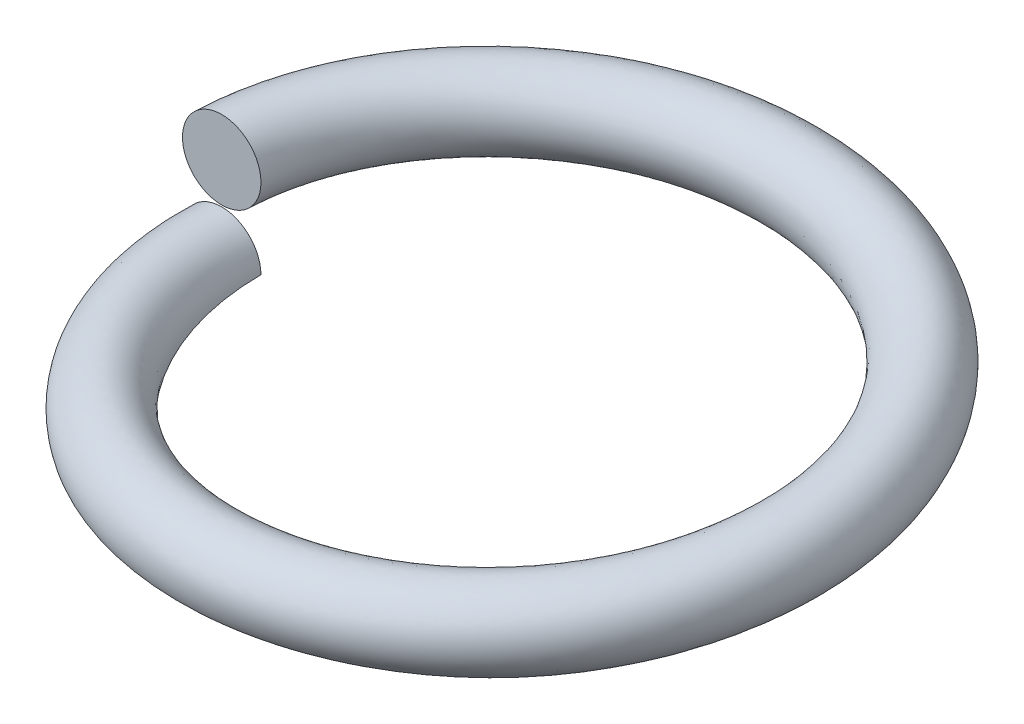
ISO-10303-21;
HEADER;
FILE_DESCRIPTION(('STEP AP214'),'2;1');
FILE_NAME('part.step','',(''),(''),'','','');
FILE_SCHEMA(('AUTOMOTIVE_DESIGN { 1 0 10303 214 1 1 1 1 }'));
ENDSEC;
DATA;
#1=APPLICATION_CONTEXT('core data for automotive mechanical design processes');
#2=APPLICATION_PROTOCOL_DEFINITION('international standard','automotive_design',2000,#1);
#3=PRODUCT_CONTEXT('',#1,'mechanical');
#4=PRODUCT('Part','Part','',(#3));
#5=PRODUCT_RELATED_PRODUCT_CATEGORY('part','',(#4));
#6=PRODUCT_DEFINITION_FORMATION('','',#4);
#7=PRODUCT_DEFINITION_CONTEXT('part definition',#1,'design');
#8=PRODUCT_DEFINITION('design','',#6,#7);
#9=PRODUCT_DEFINITION_SHAPE('','',#8);
#10=(LENGTH_UNIT() NAMED_UNIT(*) SI_UNIT(.MILLI.,.METRE.));
#11=(NAMED_UNIT(*) PLANE_ANGLE_UNIT() SI_UNIT($,.RADIAN.));
#12=(NAMED_UNIT(*) SI_UNIT($,.STERADIAN.) SOLID_ANGLE_UNIT());
#13=UNCERTAINTY_MEASURE_WITH_UNIT(LENGTH_MEASURE(1.E-05),#10,'distance_accuracy_value','');
#14=(GEOMETRIC_REPRESENTATION_CONTEXT(3) GLOBAL_UNCERTAINTY_ASSIGNED_CONTEXT((#13)) GLOBAL_UNIT_ASSIGNED_CONTEXT((#10,
#11,#12)) REPRESENTATION_CONTEXT('',''));
#15=CARTESIAN_POINT('',(0.,0.,0.));
#16=DIRECTION('',(0.,0.,1.));
#17=DIRECTION('',(1.,0.,0.));
#18=AXIS2_PLACEMENT_3D('',#15,#16,#17);
#19=CARTESIAN_POINT('',(-18.5,0.,0.));
#20=DIRECTION('',(0.,0.,1.));
#21=DIRECTION('',(1.,0.,0.));
#22=AXIS2_PLACEMENT_3D('',#19,#20,#21);
#23=PLANE('',#22);
#24=CARTESIAN_POINT('',(-18.5,0.,0.));
#25=DIRECTION('',(0.,0.,1.));
#26=DIRECTION('',(1.,0.,0.));
#27=AXIS2_PLACEMENT_3D('',#24,#25,#26);
#28=CIRCLE('',#27,2.5);
#29=CARTESIAN_POINT('',(-16.,0.,0.));
#30=VERTEX_POINT('',#29);
#31=CARTESIAN_POINT('',(-21.,0.,0.));
#32=VERTEX_POINT('',#31);
#33=EDGE_CURVE('E56',#30,#32,#28,.T.);
#34=ORIENTED_EDGE('',*,*,#33,.F.);
#35=DIRECTION('',(-1.,0.,0.));
#36=VECTOR('',#35,1.);
#37=CARTESIAN_POINT('',(-18.5,0.,0.));
#38=LINE('',#37,#36);
#39=EDGE_CURVE('E62',#30,#32,#38,.T.);
#40=ORIENTED_EDGE('',*,*,#39,.T.);
#41=EDGE_LOOP('',(#34,#40));
#42=FACE_BOUND('',#41,.T.);
#43=ADVANCED_FACE('F37',(#42),#23,.F.);
#44=CARTESIAN_POINT('',(-18.5,5.1,2.58369619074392E-13));
#45=DIRECTION('',(0.,0.,1.));
#46=DIRECTION('',(1.,0.,0.));
#47=AXIS2_PLACEMENT_3D('',#44,#45,#46);
#48=PLANE('',#47);
#49=CARTESIAN_POINT('',(-18.5,5.1,2.58369619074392E-13));
#50=DIRECTION('',(0.,0.,1.));
#51=DIRECTION('',(1.,0.,0.));
#52=AXIS2_PLACEMENT_3D('',#49,#50,#51);
#53=CIRCLE('',#52,2.5);
#54=CARTESIAN_POINT('',(-16.,5.1,2.2345480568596E-13));
#55=VERTEX_POINT('',#54);
#56=EDGE_CURVE('E50',#55,#55,#53,.T.);
#57=ORIENTED_EDGE('',*,*,#56,.T.);
#58=EDGE_LOOP('',(#57));
#59=FACE_BOUND('',#58,.T.);
#60=ADVANCED_FACE('F71',(#59),#48,.T.);
#61=CARTESIAN_POINT('',(-16.,0.,0.));
#62=CARTESIAN_POINT('',(-16.,0.424999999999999,9.23760430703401));
#63=CARTESIAN_POINT('',(-8.,0.849999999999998,13.856406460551));
#64=CARTESIAN_POINT('',(0.,1.275,18.475208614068));
#65=CARTESIAN_POINT('',(7.99999999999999,1.7,13.856406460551));
#66=CARTESIAN_POINT('',(16.,2.125,9.23760430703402));
#67=CARTESIAN_POINT('',(16.,2.54999999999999,0.));
#68=CARTESIAN_POINT('',(16.,2.97499999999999,-9.237604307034));
#69=CARTESIAN_POINT('',(8.00000000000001,3.39999999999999,-13.856406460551));
#70=CARTESIAN_POINT('',(0.,3.82499999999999,-18.475208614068));
#71=CARTESIAN_POINT('',(-7.99999999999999,4.24999999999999,-13.856406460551));
#72=CARTESIAN_POINT('',(-16.,4.67499999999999,-9.23760430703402));
#73=CARTESIAN_POINT('',(-16.,5.09999999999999,0.));
#74=CARTESIAN_POINT('',(-16.,5.,0.));
#75=CARTESIAN_POINT('',(-16.,5.425,9.23760430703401));
#76=CARTESIAN_POINT('',(-8.,5.85,13.856406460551));
#77=CARTESIAN_POINT('',(0.,6.275,18.475208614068));
#78=CARTESIAN_POINT('',(7.99999999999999,6.7,13.856406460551));
#79=CARTESIAN_POINT('',(16.,7.125,9.23760430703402));
#80=CARTESIAN_POINT('',(16.,7.55,0.));
#81=CARTESIAN_POINT('',(16.,7.975,-9.237604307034));
#82=CARTESIAN_POINT('',(8.00000000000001,8.4,-13.856406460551));
#83=CARTESIAN_POINT('',(0.,8.82499999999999,-18.475208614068));
#84=CARTESIAN_POINT('',(-7.99999999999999,9.24999999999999,-13.856406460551));
#85=CARTESIAN_POINT('',(-16.,9.67499999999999,-9.23760430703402));
#86=CARTESIAN_POINT('',(-16.,10.1,0.));
#87=CARTESIAN_POINT('',(-21.,5.,0.));
#88=CARTESIAN_POINT('',(-21.,5.425,12.1243556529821));
#89=CARTESIAN_POINT('',(-10.5,5.85,18.1865334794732));
#90=CARTESIAN_POINT('',(0.,6.275,24.2487113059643));
#91=CARTESIAN_POINT('',(10.5,6.7,18.1865334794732));
#92=CARTESIAN_POINT('',(21.,7.125,12.1243556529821));
#93=CARTESIAN_POINT('',(21.,7.55,0.));
#94=CARTESIAN_POINT('',(21.,7.975,-12.1243556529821));
#95=CARTESIAN_POINT('',(10.5,8.4,-18.1865334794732));
#96=CARTESIAN_POINT('',(0.,8.82499999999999,-24.2487113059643));
#97=CARTESIAN_POINT('',(-10.5,9.24999999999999,-18.1865334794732));
#98=CARTESIAN_POINT('',(-21.,9.67499999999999,-12.1243556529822));
#99=CARTESIAN_POINT('',(-21.,10.1,0.));
#100=CARTESIAN_POINT('',(-21.,0.,0.));
#101=CARTESIAN_POINT('',(-21.,0.424999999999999,12.1243556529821));
#102=CARTESIAN_POINT('',(-10.5,0.849999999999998,18.1865334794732));
#103=CARTESIAN_POINT('',(0.,1.275,24.2487113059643));
#104=CARTESIAN_POINT('',(10.5,1.7,18.1865334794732));
#105=CARTESIAN_POINT('',(21.,2.125,12.1243556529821));
#106=CARTESIAN_POINT('',(21.,2.54999999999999,0.));
#107=CARTESIAN_POINT('',(21.,2.97499999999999,-12.1243556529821));
#108=CARTESIAN_POINT('',(10.5,3.39999999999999,-18.1865334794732));
#109=CARTESIAN_POINT('',(0.,3.82499999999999,-24.2487113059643));
#110=CARTESIAN_POINT('',(-10.5,4.24999999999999,-18.1865334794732));
#111=CARTESIAN_POINT('',(-21.,4.67499999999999,-12.1243556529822));
#112=CARTESIAN_POINT('',(-21.,5.09999999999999,0.));
#113=CARTESIAN_POINT('',(-21.,-5.,0.));
#114=CARTESIAN_POINT('',(-21.,-4.575,12.1243556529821));
#115=CARTESIAN_POINT('',(-10.5,-4.15000000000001,18.1865334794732));
#116=CARTESIAN_POINT('',(0.,-3.72500000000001,24.2487113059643));
#117=CARTESIAN_POINT('',(10.5,-3.30000000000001,18.1865334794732));
#118=CARTESIAN_POINT('',(21.,-2.87500000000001,12.1243556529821));
#119=CARTESIAN_POINT('',(21.,-2.45000000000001,0.));
#120=CARTESIAN_POINT('',(21.,-2.02500000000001,-12.1243556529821));
#121=CARTESIAN_POINT('',(10.5,-1.60000000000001,-18.1865334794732));
#122=CARTESIAN_POINT('',(0.,-1.17500000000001,-24.2487113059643));
#123=CARTESIAN_POINT('',(-10.5,-0.750000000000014,-18.1865334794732));
#124=CARTESIAN_POINT('',(-21.,-0.325000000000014,-12.1243556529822));
#125=CARTESIAN_POINT('',(-21.,0.0999999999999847,0.));
#126=CARTESIAN_POINT('',(-16.,-5.,0.));
#127=CARTESIAN_POINT('',(-16.,-4.575,9.23760430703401));
#128=CARTESIAN_POINT('',(-8.,-4.15000000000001,13.856406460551));
#129=CARTESIAN_POINT('',(0.,-3.72500000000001,18.475208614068));
#130=CARTESIAN_POINT('',(7.99999999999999,-3.30000000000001,13.856406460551));
#131=CARTESIAN_POINT('',(16.,-2.87500000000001,9.23760430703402));
#132=CARTESIAN_POINT('',(16.,-2.45000000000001,0.));
#133=CARTESIAN_POINT('',(16.,-2.02500000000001,-9.237604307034));
#134=CARTESIAN_POINT('',(8.00000000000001,-1.60000000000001,-13.856406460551));
#135=CARTESIAN_POINT('',(0.,-1.17500000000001,-18.475208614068));
#136=CARTESIAN_POINT('',(-7.99999999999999,-0.750000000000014,-13.856406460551));
#137=CARTESIAN_POINT('',(-16.,-0.325000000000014,-9.23760430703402));
#138=CARTESIAN_POINT('',(-16.,0.0999999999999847,0.));
#139=CARTESIAN_POINT('',(-16.,0.,0.));
#140=CARTESIAN_POINT('',(-16.,0.424999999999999,9.23760430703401));
#141=CARTESIAN_POINT('',(-8.,0.849999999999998,13.856406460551));
#142=CARTESIAN_POINT('',(0.,1.275,18.475208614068));
#143=CARTESIAN_POINT('',(7.99999999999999,1.7,13.856406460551));
#144=CARTESIAN_POINT('',(16.,2.125,9.23760430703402));
#145=CARTESIAN_POINT('',(16.,2.54999999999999,0.));
#146=CARTESIAN_POINT('',(16.,2.97499999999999,-9.237604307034));
#147=CARTESIAN_POINT('',(8.00000000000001,3.39999999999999,-13.856406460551));
#148=CARTESIAN_POINT('',(0.,3.82499999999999,-18.475208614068));
#149=CARTESIAN_POINT('',(-7.99999999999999,4.24999999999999,-13.856406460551));
#150=CARTESIAN_POINT('',(-16.,4.67499999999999,-9.23760430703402));
#151=CARTESIAN_POINT('',(-16.,5.09999999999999,0.));
#152=(BOUNDED_SURFACE() B_SPLINE_SURFACE(3,2,((#61,#62,#63,#64,#65,#66,#67,#68,#69,#70,#71,#72,
#73),(#74,#75,#76,#77,#78,#79,#80,#81,#82,#83,#84,#85,#86),(#87,#88,#89,#90,#91,#92,#93,#94,#95,
#96,#97,#98,#99),(#100,#101,#102,#103,#104,#105,#106,#107,#108,#109,#110,#111,#112),(#113,#114,
#115,#116,#117,#118,#119,#120,#121,#122,#123,#124,#125),(#126,#127,#128,#129,#130,#131,#132,
#133,#134,#135,#136,#137,#138),(#139,#140,#141,#142,#143,#144,#145,#146,#147,#148,#149,#150,
#151)),.UNSPECIFIED.,.T.,.F.,.F.) B_SPLINE_SURFACE_WITH_KNOTS((4,3,4),(3,2,2,2,2,2,3),(0.,0.5,
1.),(0.,0.166666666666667,0.333333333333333,0.5,0.666666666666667,0.833333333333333,1.),
.UNSPECIFIED.) GEOMETRIC_REPRESENTATION_ITEM() RATIONAL_B_SPLINE_SURFACE(((1.,0.866025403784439,
1.,0.866025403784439,1.,0.866025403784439,1.,0.866025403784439,1.,0.866025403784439,1.,
0.866025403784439,1.),(0.333333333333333,0.288675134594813,0.333333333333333,0.288675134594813,
0.333333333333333,0.288675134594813,0.333333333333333,0.288675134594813,0.333333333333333,
0.288675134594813,0.333333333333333,0.288675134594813,0.333333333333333),(0.333333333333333,
0.288675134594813,0.333333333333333,0.288675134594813,0.333333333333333,0.288675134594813,
0.333333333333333,0.288675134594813,0.333333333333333,0.288675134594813,0.333333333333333,
0.288675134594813,0.333333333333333),(1.,0.866025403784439,1.,0.866025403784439,1.,
0.866025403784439,1.,0.866025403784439,1.,0.866025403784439,1.,0.866025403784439,1.),
(0.333333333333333,0.288675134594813,0.333333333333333,0.288675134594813,0.333333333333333,
0.288675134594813,0.333333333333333,0.288675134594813,0.333333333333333,0.288675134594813,
0.333333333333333,0.288675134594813,0.333333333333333),(0.333333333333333,0.288675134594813,
0.333333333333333,0.288675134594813,0.333333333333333,0.288675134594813,0.333333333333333,
0.288675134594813,0.333333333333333,0.288675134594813,0.333333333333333,0.288675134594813,
0.333333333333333),(1.,0.866025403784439,1.,0.866025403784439,1.,0.866025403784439,1.,
0.866025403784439,1.,0.866025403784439,1.,0.866025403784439,1.))) REPRESENTATION_ITEM('') SURFACE());
#153=CARTESIAN_POINT('',(-16.,0.,0.));
#154=CARTESIAN_POINT('',(-16.0000346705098,0.,0.422657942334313));
#155=CARTESIAN_POINT('',(-15.9834809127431,0.,0.845306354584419));
#156=CARTESIAN_POINT('',(-15.9175112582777,0.,1.68800572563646));
#157=CARTESIAN_POINT('',(-15.868097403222,0.,2.10805684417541));
#158=CARTESIAN_POINT('',(-15.7367751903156,0.,2.94269958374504));
#159=CARTESIAN_POINT('',(-15.6548930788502,0.,3.35729533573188));
#160=CARTESIAN_POINT('',(-15.459184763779,0.,4.17887709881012));
#161=CARTESIAN_POINT('',(-15.345358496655,0.,4.58586309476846));
#162=CARTESIAN_POINT('',(-15.0864823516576,0.,5.38977753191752));
#163=CARTESIAN_POINT('',(-14.9414326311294,0.,5.78670602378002));
#164=CARTESIAN_POINT('',(-14.6209502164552,0.,6.56827460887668));
#165=CARTESIAN_POINT('',(-14.4455061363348,0.,6.95291003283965));
#166=CARTESIAN_POINT('',(-14.0653134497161,0.,7.70749106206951));
#167=CARTESIAN_POINT('',(-13.8605603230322,0.,8.07743439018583));
#168=CARTESIAN_POINT('',(-13.4230888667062,0.,8.80021907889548));
#169=CARTESIAN_POINT('',(-13.1903799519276,0.,9.15306614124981));
#170=CARTESIAN_POINT('',(-12.6768443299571,0.,9.8696584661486));
#171=CARTESIAN_POINT('',(-12.3935907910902,0.,10.2316680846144));
#172=CARTESIAN_POINT('',(-11.7975783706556,0.,10.930560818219));
#173=CARTESIAN_POINT('',(-11.4848174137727,0.,11.2674421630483));
#174=CARTESIAN_POINT('',(-10.8319645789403,0.,11.9136899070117));
#175=CARTESIAN_POINT('',(-10.4918680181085,0.,12.2230515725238));
#176=CARTESIAN_POINT('',(-9.78672721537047,0.,12.8119784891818));
#177=CARTESIAN_POINT('',(-9.42168366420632,0.,13.0915445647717));
#178=CARTESIAN_POINT('',(-8.85776552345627,0.,13.4867545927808));
#179=CARTESIAN_POINT('',(-8.66719515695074,0.,13.6143937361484));
#180=CARTESIAN_POINT('',(-8.28086063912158,0.,13.8614434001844));
#181=CARTESIAN_POINT('',(-8.08509778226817,0.,13.9808559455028));
#182=CARTESIAN_POINT('',(-7.49057589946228,0.,14.3267675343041));
#183=CARTESIAN_POINT('',(-7.08456311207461,0.,14.5409548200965));
#184=CARTESIAN_POINT('',(-6.2562681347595,0.,14.9350193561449));
#185=CARTESIAN_POINT('',(-5.83398555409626,0.,15.1148957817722));
#186=CARTESIAN_POINT('',(-4.97602532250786,0.,15.4392210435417));
#187=CARTESIAN_POINT('',(-4.54034791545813,0.,15.5836705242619));
#188=CARTESIAN_POINT('',(-3.65217585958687,0.,15.8380843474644));
#189=CARTESIAN_POINT('',(-3.19952877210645,0.,15.9475165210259));
#190=CARTESIAN_POINT('',(-2.28668906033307,0.,16.1283196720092));
#191=CARTESIAN_POINT('',(-1.82649627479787,0.,16.1996898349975));
#192=CARTESIAN_POINT('',(-0.901652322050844,0.,16.303960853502));
#193=CARTESIAN_POINT('',(-0.437000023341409,0.,16.3368516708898));
#194=CARTESIAN_POINT('',(0.493424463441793,0.,16.363968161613));
#195=CARTESIAN_POINT('',(0.959196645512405,0.,16.3581940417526));
#196=CARTESIAN_POINT('',(1.89503881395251,0.,16.3077242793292));
#197=CARTESIAN_POINT('',(2.36508022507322,0.,16.2624963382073));
#198=CARTESIAN_POINT('',(3.29970922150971,0.,16.1327564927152));
#199=CARTESIAN_POINT('',(3.76429659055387,0.,16.048243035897));
#200=CARTESIAN_POINT('',(4.68436470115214,0.,15.8406141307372));
#201=CARTESIAN_POINT('',(5.1398537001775,0.,15.7175355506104));
#202=CARTESIAN_POINT('',(5.81401221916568,0.,15.5046608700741));
#203=CARTESIAN_POINT('',(6.03723516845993,0.,15.428986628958));
#204=CARTESIAN_POINT('',(6.48032438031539,0.,15.2683345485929));
#205=CARTESIAN_POINT('',(6.70019065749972,0.,15.1833567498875));
#206=CARTESIAN_POINT('',(7.13664646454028,0.,15.00404618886));
#207=CARTESIAN_POINT('',(7.35322750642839,0.,14.9096928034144));
#208=CARTESIAN_POINT('',(7.78223448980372,0.,14.7119497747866));
#209=CARTESIAN_POINT('',(7.99466043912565,0.,14.6085601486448));
#210=CARTESIAN_POINT('',(8.30987795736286,0.,14.4468319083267));
#211=CARTESIAN_POINT('',(8.41438541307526,0.,14.3918122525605));
#212=CARTESIAN_POINT('',(8.62228398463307,0.,14.2797022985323));
#213=CARTESIAN_POINT('',(8.72567509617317,0.,14.2226119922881));
#214=CARTESIAN_POINT('',(9.03410111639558,0.,14.0482511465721));
#215=CARTESIAN_POINT('',(9.23739721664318,0.,13.9278863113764));
#216=CARTESIAN_POINT('',(9.63953429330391,0.,13.6788435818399));
#217=CARTESIAN_POINT('',(9.83836282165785,0.,13.5501456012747));
#218=CARTESIAN_POINT('',(10.230733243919,0.,13.2849563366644));
#219=CARTESIAN_POINT('',(10.4242751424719,0.,13.1484650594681));
#220=CARTESIAN_POINT('',(10.9965813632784,0.,12.7276438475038));
#221=CARTESIAN_POINT('',(11.3670904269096,0.,12.4319267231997));
#222=CARTESIAN_POINT('',(11.9747109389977,0.,11.9067521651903));
#223=CARTESIAN_POINT('',(12.2181197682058,0.,11.6844987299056));
#224=CARTESIAN_POINT('',(12.6926081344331,0.,11.2271701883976));
#225=CARTESIAN_POINT('',(12.9236877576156,0.,10.9920951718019));
#226=CARTESIAN_POINT('',(13.3729089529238,0.,10.5100014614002));
#227=CARTESIAN_POINT('',(13.5910533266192,0.,10.2629853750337));
#228=CARTESIAN_POINT('',(14.012851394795,0.,9.75918687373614));
#229=CARTESIAN_POINT('',(14.2165781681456,0.,9.50246562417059));
#230=CARTESIAN_POINT('',(14.6105232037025,0.,8.9788170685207));
#231=CARTESIAN_POINT('',(14.8007397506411,0.,8.71188847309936));
#232=CARTESIAN_POINT('',(15.1674942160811,0.,8.16860163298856));
#233=CARTESIAN_POINT('',(15.3440253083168,0.,7.89223878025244));
#234=CARTESIAN_POINT('',(15.6490406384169,0.,7.38766880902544));
#235=CARTESIAN_POINT('',(15.7800400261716,0.,7.16097579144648));
#236=CARTESIAN_POINT('',(16.0332404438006,0.,6.70273465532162));
#237=CARTESIAN_POINT('',(16.1554416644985,0.,6.47118664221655));
#238=CARTESIAN_POINT('',(16.3911547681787,0.,6.00383464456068));
#239=CARTESIAN_POINT('',(16.5046701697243,0.,5.76803243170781));
#240=CARTESIAN_POINT('',(16.723286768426,0.,5.29285100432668));
#241=CARTESIAN_POINT('',(16.8283962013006,0.,5.05347557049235));
#242=CARTESIAN_POINT('',(17.0314471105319,0.,4.57022362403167));
#243=CARTESIAN_POINT('',(17.1293477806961,0.,4.32633001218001));
#244=CARTESIAN_POINT('',(17.271220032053,0.,3.95858383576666));
#245=CARTESIAN_POINT('',(17.3176817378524,0.,3.83568204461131));
#246=CARTESIAN_POINT('',(17.4091907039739,0.,3.58935675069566));
#247=CARTESIAN_POINT('',(17.4542380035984,0.,3.46593326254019));
#248=CARTESIAN_POINT('',(17.5432616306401,0.,3.21868864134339));
#249=CARTESIAN_POINT('',(17.5872378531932,0.,3.09486747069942));
#250=CARTESIAN_POINT('',(17.674656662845,0.,2.84702266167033));
#251=CARTESIAN_POINT('',(17.7180991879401,0.,2.7229990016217));
#252=CARTESIAN_POINT('',(17.8052950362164,0.,2.47510282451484));
#253=CARTESIAN_POINT('',(17.8490482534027,0.,2.35123027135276));
#254=CARTESIAN_POINT('',(17.9162347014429,0.,2.16599649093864));
#255=CARTESIAN_POINT('',(17.938887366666,0.,2.10435364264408));
#256=CARTESIAN_POINT('',(17.9851200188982,0.,1.98141780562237));
#257=CARTESIAN_POINT('',(18.0086999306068,0.,1.92012478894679));
#258=CARTESIAN_POINT('',(18.0453846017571,0.,1.82836980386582));
#259=CARTESIAN_POINT('',(18.0578943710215,0.,1.79767063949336));
#260=CARTESIAN_POINT('',(18.0834638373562,0.,1.73649715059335));
#261=CARTESIAN_POINT('',(18.0965235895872,0.,1.70602284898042));
#262=CARTESIAN_POINT('',(18.1233556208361,0.,1.64546981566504));
#263=CARTESIAN_POINT('',(18.1371262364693,0.,1.61539035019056));
#264=CARTESIAN_POINT('',(18.1656956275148,0.,1.55572479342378));
#265=CARTESIAN_POINT('',(18.1804941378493,1.50643309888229E-13,1.52613857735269));
#266=CARTESIAN_POINT('',(18.2057178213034,1.00435886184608E-13,1.47883406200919));
#267=CARTESIAN_POINT('',(18.215675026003,0.,1.46086729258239));
#268=CARTESIAN_POINT('',(18.2363870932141,0.,1.42535523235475));
#269=CARTESIAN_POINT('',(18.2471431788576,0.,1.40781064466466));
#270=CARTESIAN_POINT('',(18.2700133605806,0.,1.37298333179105));
#271=CARTESIAN_POINT('',(18.2821549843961,0.,1.35571853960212));
#272=CARTESIAN_POINT('',(18.3080474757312,0.,1.32244179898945));
#273=CARTESIAN_POINT('',(18.3217943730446,0.,1.30642691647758));
#274=CARTESIAN_POINT('',(18.3436742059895,0.,1.28488919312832));
#275=CARTESIAN_POINT('',(18.3508151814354,0.,1.27838158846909));
#276=CARTESIAN_POINT('',(18.3657306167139,0.,1.26614935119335));
#277=CARTESIAN_POINT('',(18.3735054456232,0.,1.26042518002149));
#278=CARTESIAN_POINT('',(18.3952865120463,0.,1.24673355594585));
#279=CARTESIAN_POINT('',(18.4100349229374,0.,1.23975761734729));
#280=CARTESIAN_POINT('',(18.4314150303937,0.,1.23446413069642));
#281=CARTESIAN_POINT('',(18.437375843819,0.,1.23345998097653));
#282=CARTESIAN_POINT('',(18.449381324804,0.,1.232475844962));
#283=CARTESIAN_POINT('',(18.4554259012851,0.,1.23249482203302));
#284=CARTESIAN_POINT('',(18.4674196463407,0.,1.23359455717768));
#285=CARTESIAN_POINT('',(18.4733687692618,0.,1.23467580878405));
#286=CARTESIAN_POINT('',(18.4850113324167,0.,1.23781214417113));
#287=CARTESIAN_POINT('',(18.4907042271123,1.44630755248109E-13,1.23986920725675));
#288=CARTESIAN_POINT('',(18.5113475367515,3.42718788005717E-13,1.24908638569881));
#289=CARTESIAN_POINT('',(18.5251000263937,0.,1.25888413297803));
#290=CARTESIAN_POINT('',(18.5488210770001,0.,1.28032286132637));
#291=CARTESIAN_POINT('',(18.5590008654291,0.,1.29176097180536));
#292=CARTESIAN_POINT('',(18.5777919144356,0.,1.31590813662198));
#293=CARTESIAN_POINT('',(18.586397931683,0.,1.32862122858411));
#294=CARTESIAN_POINT('',(18.6077859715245,0.,1.36346310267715));
#295=CARTESIAN_POINT('',(18.6195230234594,0.,1.38621453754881));
#296=CARTESIAN_POINT('',(18.6409707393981,0.,1.43266959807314));
#297=CARTESIAN_POINT('',(18.6506767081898,0.,1.45637528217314));
#298=CARTESIAN_POINT('',(18.6686824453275,0.,1.50445003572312));
#299=CARTESIAN_POINT('',(18.6769746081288,0.,1.52882192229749));
#300=CARTESIAN_POINT('',(18.6924481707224,0.,1.5778767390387));
#301=CARTESIAN_POINT('',(18.6996309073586,0.,1.60255925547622));
#302=CARTESIAN_POINT('',(18.7163927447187,0.,1.66413716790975));
#303=CARTESIAN_POINT('',(18.7254535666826,0.,1.70117304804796));
#304=CARTESIAN_POINT('',(18.7421418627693,0.,1.77556921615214));
#305=CARTESIAN_POINT('',(18.7497689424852,0.,1.81292959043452));
#306=CARTESIAN_POINT('',(18.7709690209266,0.,1.92548141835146));
#307=CARTESIAN_POINT('',(18.7828237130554,0.,2.00099625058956));
#308=CARTESIAN_POINT('',(18.8032661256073,0.,2.15252004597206));
#309=CARTESIAN_POINT('',(18.8118505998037,0.,2.22852942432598));
#310=CARTESIAN_POINT('',(18.8263981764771,0.,2.38082862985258));
#311=CARTESIAN_POINT('',(18.8323601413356,0.,2.45711856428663));
#312=CARTESIAN_POINT('',(18.8420652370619,0.,2.60973193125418));
#313=CARTESIAN_POINT('',(18.8458113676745,0.,2.68605517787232));
#314=CARTESIAN_POINT('',(18.8513608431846,0.,2.83873894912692));
#315=CARTESIAN_POINT('',(18.8531649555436,0.,2.91509944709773));
#316=CARTESIAN_POINT('',(18.8563756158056,0.,3.17743546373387));
#317=CARTESIAN_POINT('',(18.8534969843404,0.,3.36347292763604));
#318=CARTESIAN_POINT('',(18.8390895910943,0.,3.73523506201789));
#319=CARTESIAN_POINT('',(18.8275581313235,0.,3.92095961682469));
#320=CARTESIAN_POINT('',(18.7967111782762,0.,4.29201746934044));
#321=CARTESIAN_POINT('',(18.7773849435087,0.,4.47734987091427));
#322=CARTESIAN_POINT('',(18.7315324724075,0.,4.84712851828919));
#323=CARTESIAN_POINT('',(18.7050053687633,0.,5.03157465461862));
#324=CARTESIAN_POINT('',(18.6152174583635,0.,5.58346951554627));
#325=CARTESIAN_POINT('',(18.5417650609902,0.,5.94930384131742));
#326=CARTESIAN_POINT('',(18.3699776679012,0.,6.67476554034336));
#327=CARTESIAN_POINT('',(18.2716567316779,0.,7.03439629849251));
#328=CARTESIAN_POINT('',(18.0140127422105,0.,7.86789579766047));
#329=CARTESIAN_POINT('',(17.8453210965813,0.,8.33889556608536));
#330=CARTESIAN_POINT('',(17.4685000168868,0.,9.26500299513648));
#331=CARTESIAN_POINT('',(17.260352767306,0.,9.72010336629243));
#332=CARTESIAN_POINT('',(16.8071008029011,0.,10.6114035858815));
#333=CARTESIAN_POINT('',(16.5620023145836,0.,11.0476066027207));
#334=CARTESIAN_POINT('',(16.0371647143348,0.,11.8985421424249));
#335=CARTESIAN_POINT('',(15.7574302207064,0.,12.3132775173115));
#336=CARTESIAN_POINT('',(15.1631381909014,0.,13.122275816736));
#337=CARTESIAN_POINT('',(14.8483125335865,0.,13.5163417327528));
#338=CARTESIAN_POINT('',(14.1881473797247,0.,14.2780081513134));
#339=CARTESIAN_POINT('',(13.8428070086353,0.,14.6456078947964));
#340=CARTESIAN_POINT('',(13.1239045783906,0.,15.3524141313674));
#341=CARTESIAN_POINT('',(12.7503331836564,0.,15.6916111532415));
#342=CARTESIAN_POINT('',(12.1709378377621,0.,16.1774873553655));
#343=CARTESIAN_POINT('',(11.974619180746,0.,16.3356360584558));
#344=CARTESIAN_POINT('',(11.5759040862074,0.,16.6441247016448));
#345=CARTESIAN_POINT('',(11.373507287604,0.,16.7944641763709));
#346=CARTESIAN_POINT('',(10.9507680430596,0.,17.0958324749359));
#347=CARTESIAN_POINT('',(10.7300747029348,0.,17.2463691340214));
#348=CARTESIAN_POINT('',(10.2826414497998,0.,17.5381673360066));
#349=CARTESIAN_POINT('',(10.0559014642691,0.,17.6794287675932));
#350=CARTESIAN_POINT('',(9.5969669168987,0.,17.9528891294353));
#351=CARTESIAN_POINT('',(9.36477140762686,0.,18.0850864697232));
#352=CARTESIAN_POINT('',(8.89531905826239,0.,18.3401295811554));
#353=CARTESIAN_POINT('',(8.65806228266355,0.,18.4629754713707));
#354=CARTESIAN_POINT('',(7.93978884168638,0.,18.8169400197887));
#355=CARTESIAN_POINT('',(7.45167288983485,0.,19.0338407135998));
#356=CARTESIAN_POINT('',(6.45993807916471,0.,19.4281037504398));
#357=CARTESIAN_POINT('',(5.95632494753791,0.,19.605480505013));
#358=CARTESIAN_POINT('',(5.18181819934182,0.,19.8441519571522));
#359=CARTESIAN_POINT('',(4.91541416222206,0.,19.9202632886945));
#360=CARTESIAN_POINT('',(4.37974987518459,0.,20.0614239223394));
#361=CARTESIAN_POINT('',(4.11049019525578,0.,20.1264753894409));
#362=CARTESIAN_POINT('',(3.29889108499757,0.,20.304918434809));
#363=CARTESIAN_POINT('',(2.75277559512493,0.,20.4015851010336));
#364=CARTESIAN_POINT('',(1.64692520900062,0.,20.5506391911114));
#365=CARTESIAN_POINT('',(1.0871063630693,0.,20.6023972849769));
#366=CARTESIAN_POINT('',(-0.0351548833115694,0.,20.6590818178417));
#367=CARTESIAN_POINT('',(-0.597598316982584,0.,20.663987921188));
#368=CARTESIAN_POINT('',(-1.72100207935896,0.,20.6269377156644));
#369=CARTESIAN_POINT('',(-2.28196223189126,0.,20.5849760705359));
#370=CARTESIAN_POINT('',(-3.39819517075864,0.,20.4545848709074));
#371=CARTESIAN_POINT('',(-3.95347026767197,0.,20.3661750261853));
#372=CARTESIAN_POINT('',(-5.05355390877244,0.,20.1438228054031));
#373=CARTESIAN_POINT('',(-5.59838374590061,0.,20.0099865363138));
#374=CARTESIAN_POINT('',(-6.40566920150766,0.,19.7759019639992));
#375=CARTESIAN_POINT('',(-6.67306309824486,0.,19.6923345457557));
#376=CARTESIAN_POINT('',(-7.20422606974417,0.,19.5142199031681));
#377=CARTESIAN_POINT('',(-7.46799434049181,0.,19.4196702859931));
#378=CARTESIAN_POINT('',(-8.2598447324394,0.,19.1172300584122));
#379=CARTESIAN_POINT('',(-8.78165684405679,0.,18.8925215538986));
#380=CARTESIAN_POINT('',(-9.54887715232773,0.,18.5234992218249));
#381=CARTESIAN_POINT('',(-9.8021082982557,0.,18.3951216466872));
#382=CARTESIAN_POINT('',(-10.3029993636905,0.,18.1279203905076));
#383=CARTESIAN_POINT('',(-10.5506593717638,0.,17.9890968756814));
#384=CARTESIAN_POINT('',(-11.2857139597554,0.,17.5570047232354));
#385=CARTESIAN_POINT('',(-11.7642908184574,0.,17.2485448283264));
#386=CARTESIAN_POINT('',(-12.6943164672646,0.,16.5933446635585));
#387=CARTESIAN_POINT('',(-13.1457682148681,0.,16.2466085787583));
#388=CARTESIAN_POINT('',(-14.0263346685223,0.,15.5106460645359));
#389=CARTESIAN_POINT('',(-14.4549116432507,0.,15.1207754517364));
#390=CARTESIAN_POINT('',(-15.2778902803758,0.,14.3064085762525));
#391=CARTESIAN_POINT('',(-15.6722878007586,0.,13.8819081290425));
#392=CARTESIAN_POINT('',(-16.4234388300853,0.,13.0020239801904));
#393=CARTESIAN_POINT('',(-16.7802536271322,0.,12.5466926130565));
#394=CARTESIAN_POINT('',(-17.454335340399,0.,11.6079103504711));
#395=CARTESIAN_POINT('',(-17.7716163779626,0.,11.1244695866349));
#396=CARTESIAN_POINT('',(-18.3621377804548,0.,10.136740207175));
#397=CARTESIAN_POINT('',(-18.6357202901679,0.,9.63265679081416));
#398=CARTESIAN_POINT('',(-19.0138388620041,0.,8.86111503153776));
#399=CARTESIAN_POINT('',(-19.1344750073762,0.,8.60143538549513));
#400=CARTESIAN_POINT('',(-19.3648917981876,0.,8.07723320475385));
#401=CARTESIAN_POINT('',(-19.4746697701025,-1.51172708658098E-13,7.81270949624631));
#402=CARTESIAN_POINT('',(-19.8122921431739,-2.99080816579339E-13,6.94887214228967));
#403=CARTESIAN_POINT('',(-20.0179589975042,0.,6.34070340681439));
#404=CARTESIAN_POINT('',(-20.372043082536,0.,5.10766307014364));
#405=CARTESIAN_POINT('',(-20.5204247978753,0.,4.4827813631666));
#406=CARTESIAN_POINT('',(-20.7594143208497,0.,3.21754642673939));
#407=CARTESIAN_POINT('',(-20.8496241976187,0.,2.57711709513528));
#408=CARTESIAN_POINT('',(-20.9398416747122,0.,1.61263151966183));
#409=CARTESIAN_POINT('',(-20.9623979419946,0.,1.29053339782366));
#410=CARTESIAN_POINT('',(-20.9924766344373,0.,0.645639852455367));
#411=CARTESIAN_POINT('',(-20.9999992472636,0.,0.322844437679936));
#412=CARTESIAN_POINT('',(-21.,0.,0.));
#413=B_SPLINE_CURVE_WITH_KNOTS('',3,(#153,#154,#155,#156,#157,#158,#159,#160,#161,#162,#163,
#164,#165,#166,#167,#168,#169,#170,#171,#172,#173,#174,#175,#176,#177,#178,#179,#180,#181,#182,
#183,#184,#185,#186,#187,#188,#189,#190,#191,#192,#193,#194,#195,#196,#197,#198,#199,#200,#201,
#202,#203,#204,#205,#206,#207,#208,#209,#210,#211,#212,#213,#214,#215,#216,#217,#218,#219,#220,
#221,#222,#223,#224,#225,#226,#227,#228,#229,#230,#231,#232,#233,#234,#235,#236,#237,#238,#239,
#240,#241,#242,#243,#244,#245,#246,#247,#248,#249,#250,#251,#252,#253,#254,#255,#256,#257,#258,
#259,#260,#261,#262,#263,#264,#265,#266,#267,#268,#269,#270,#271,#272,#273,#274,#275,#276,#277,
#278,#279,#280,#281,#282,#283,#284,#285,#286,#287,#288,#289,#290,#291,#292,#293,#294,#295,#296,
#297,#298,#299,#300,#301,#302,#303,#304,#305,#306,#307,#308,#309,#310,#311,#312,#313,#314,#315,
#316,#317,#318,#319,#320,#321,#322,#323,#324,#325,#326,#327,#328,#329,#330,#331,#332,#333,#334,
#335,#336,#337,#338,#339,#340,#341,#342,#343,#344,#345,#346,#347,#348,#349,#350,#351,#352,#353,
#354,#355,#356,#357,#358,#359,#360,#361,#362,#363,#364,#365,#366,#367,#368,#369,#370,#371,#372,
#373,#374,#375,#376,#377,#378,#379,#380,#381,#382,#383,#384,#385,#386,#387,#388,#389,#390,#391,
#392,#393,#394,#395,#396,#397,#398,#399,#400,#401,#402,#403,#404,#405,#406,#407,#408,#409,#410,
#411,#412),.UNSPECIFIED.,.F.,.F.,(4,2,2,2,2,2,2,2,2,2,2,2,2,2,2,2,2,2,2,2,2,2,2,2,2,2,2,2,2,2,2,
2,2,2,2,2,2,2,2,2,2,2,2,2,2,2,2,2,2,2,2,2,2,2,2,2,2,2,2,2,2,2,2,2,2,2,2,2,2,2,2,2,2,2,2,2,2,2,2,
2,2,2,2,2,2,2,2,2,2,2,2,2,2,2,2,2,2,2,2,2,2,2,2,2,2,2,2,2,2,2,2,2,2,2,2,2,2,2,2,2,2,2,2,2,2,2,2,
2,2,4),(0.,1.26763615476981,2.53519355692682,3.80172838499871,5.06826573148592,6.33479669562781,
7.60180314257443,8.86900520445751,10.1357816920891,11.5130954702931,12.8905061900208,
14.2681533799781,15.6457624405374,16.333682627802,17.0214329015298,18.3968588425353,
19.7723178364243,21.1477518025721,22.5431922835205,23.9386626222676,25.3344969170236,
26.7303237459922,28.1452790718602,29.5602903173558,30.9739529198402,31.6808872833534,
32.3878185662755,33.0963408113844,33.8048617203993,34.1591579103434,34.5134554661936,
35.2220219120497,35.9323649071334,36.6427072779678,38.0631659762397,39.0515807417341,
40.0399885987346,41.0281815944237,42.0109412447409,42.993825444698,43.9771967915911,
44.7624728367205,45.547731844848,46.3326710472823,47.1168315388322,47.9051351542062,
48.2993003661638,48.6934546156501,49.0876473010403,49.4818853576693,49.8759948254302,
50.0730116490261,50.2700125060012,50.3694593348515,50.4689161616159,50.5681499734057,
50.6673582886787,50.7289696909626,50.7906774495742,50.8539505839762,50.9170704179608,
50.9460038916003,50.9749543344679,51.0228951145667,51.0409533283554,51.0589932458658,
51.0770415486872,51.0951266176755,51.1447995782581,51.1906055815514,51.23656152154,
51.3131804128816,51.3899745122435,51.4671695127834,51.5442707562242,51.6586130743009,
51.7729868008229,52.0021891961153,52.2316185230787,52.4611472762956,52.6903645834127,
52.9194912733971,53.4773983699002,54.0354794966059,54.594332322,55.1532524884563,
56.2716060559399,57.3893287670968,58.8882452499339,60.3878401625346,61.8871826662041,
63.3863254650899,64.8978297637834,66.4093773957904,67.9214270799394,68.6775535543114,
69.4337250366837,70.2349301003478,71.036144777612,71.8374996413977,72.6388442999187,
74.2394577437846,75.8394866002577,76.6704661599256,77.5012828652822,79.1630540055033,
80.8477528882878,82.5331829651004,84.2188049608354,85.9037122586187,87.5847107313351,
88.42494507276,89.2653628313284,90.9674220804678,91.8189654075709,92.6704951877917,
94.3765175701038,96.0823536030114,97.8184243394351,99.5547051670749,101.288109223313,
103.020892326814,104.739361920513,105.598144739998,106.457138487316,108.380087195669,
110.304226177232,112.241391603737,113.209751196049,114.178098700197),.UNSPECIFIED.);
#414=EDGE_CURVE('E12',#30,#32,#413,.T.);
#415=ORIENTED_EDGE('',*,*,#414,.F.);
#416=ORIENTED_EDGE('',*,*,#33,.T.);
#417=EDGE_LOOP('',(#415,#416));
#418=FACE_BOUND('',#417,.T.);
#419=ORIENTED_EDGE('',*,*,#56,.F.);
#420=EDGE_LOOP('',(#419));
#421=FACE_BOUND('',#420,.T.);
#422=ADVANCED_FACE('F58',(#418,#421),#152,.T.);
#423=CARTESIAN_POINT('',(0.,0.,0.));
#424=DIRECTION('',(0.,1.,0.));
#425=DIRECTION('',(0.,0.,1.));
#426=AXIS2_PLACEMENT_3D('',#423,#424,#425);
#427=PLANE('',#426);
#428=ORIENTED_EDGE('',*,*,#39,.F.);
#429=ORIENTED_EDGE('',*,*,#414,.T.);
#430=EDGE_LOOP('',(#428,#429));
#431=FACE_BOUND('',#430,.T.);
#432=ADVANCED_FACE('F66',(#431),#427,.F.);
#433=CLOSED_SHELL('',(#43,#60,#422,#432));
#434=MANIFOLD_SOLID_BREP('B2',#433);
#435=ADVANCED_BREP_SHAPE_REPRESENTATION('',(#18,#434),#14);
#436=SHAPE_DEFINITION_REPRESENTATION(#9,#435);
ENDSEC;
END-ISO-10303-21;
